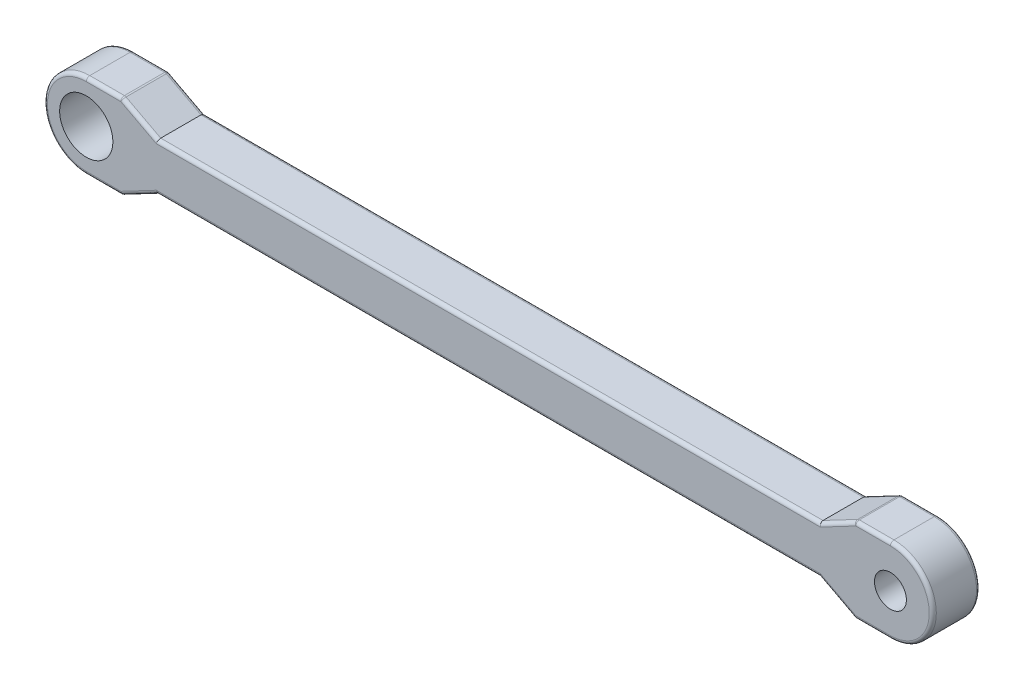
ISO-10303-21;
HEADER;
FILE_DESCRIPTION(('STEP AP214'),'2;1');
FILE_NAME('part.step','',(''),(''),'','','');
FILE_SCHEMA(('AUTOMOTIVE_DESIGN { 1 0 10303 214 1 1 1 1 }'));
ENDSEC;
DATA;
#1=APPLICATION_CONTEXT('core data for automotive mechanical design processes');
#2=APPLICATION_PROTOCOL_DEFINITION('international standard','automotive_design',2000,#1);
#3=PRODUCT_CONTEXT('',#1,'mechanical');
#4=PRODUCT('Part','Part','',(#3));
#5=PRODUCT_RELATED_PRODUCT_CATEGORY('part','',(#4));
#6=PRODUCT_DEFINITION_FORMATION('','',#4);
#7=PRODUCT_DEFINITION_CONTEXT('part definition',#1,'design');
#8=PRODUCT_DEFINITION('design','',#6,#7);
#9=PRODUCT_DEFINITION_SHAPE('','',#8);
#10=(LENGTH_UNIT() NAMED_UNIT(*) SI_UNIT(.MILLI.,.METRE.));
#11=(NAMED_UNIT(*) PLANE_ANGLE_UNIT() SI_UNIT($,.RADIAN.));
#12=(NAMED_UNIT(*) SI_UNIT($,.STERADIAN.) SOLID_ANGLE_UNIT());
#13=UNCERTAINTY_MEASURE_WITH_UNIT(LENGTH_MEASURE(1.E-05),#10,'distance_accuracy_value','');
#14=(GEOMETRIC_REPRESENTATION_CONTEXT(3) GLOBAL_UNCERTAINTY_ASSIGNED_CONTEXT((#13)) GLOBAL_UNIT_ASSIGNED_CONTEXT((#10,
#11,#12)) REPRESENTATION_CONTEXT('',''));
#15=CARTESIAN_POINT('',(0.,0.,0.));
#16=DIRECTION('',(0.,0.,1.));
#17=DIRECTION('',(1.,0.,0.));
#18=AXIS2_PLACEMENT_3D('',#15,#16,#17);
#19=CARTESIAN_POINT('',(-43.18,0.,5.08));
#20=DIRECTION('',(0.,0.,1.));
#21=DIRECTION('',(1.,0.,0.));
#22=AXIS2_PLACEMENT_3D('',#19,#20,#21);
#23=PLANE('',#22);
#24=CARTESIAN_POINT('',(-43.18,0.,5.08));
#25=DIRECTION('',(0.,0.,1.));
#26=DIRECTION('',(1.,0.,0.));
#27=AXIS2_PLACEMENT_3D('',#24,#25,#26);
#28=CIRCLE('',#27,2.8575);
#29=CARTESIAN_POINT('',(-40.3225,0.,5.08));
#30=VERTEX_POINT('',#29);
#31=EDGE_CURVE('E1100',#30,#30,#28,.T.);
#32=ORIENTED_EDGE('',*,*,#31,.F.);
#33=EDGE_LOOP('',(#32));
#34=FACE_BOUND('',#33,.T.);
#35=CARTESIAN_POINT('',(43.18,0.,5.08));
#36=DIRECTION('',(0.,0.,-1.));
#37=DIRECTION('',(-1.,0.,0.));
#38=AXIS2_PLACEMENT_3D('',#35,#36,#37);
#39=CIRCLE('',#38,1.7145);
#40=CARTESIAN_POINT('',(41.4655,0.,5.08));
#41=VERTEX_POINT('',#40);
#42=EDGE_CURVE('E485',#41,#41,#39,.T.);
#43=ORIENTED_EDGE('',*,*,#42,.T.);
#44=EDGE_LOOP('',(#43));
#45=FACE_BOUND('',#44,.T.);
#46=DIRECTION('',(-1.,0.,0.));
#47=VECTOR('',#46,1.);
#48=CARTESIAN_POINT('',(-43.18,4.167,5.08));
#49=LINE('',#48,#47);
#50=CARTESIAN_POINT('',(-39.4642553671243,4.167,5.08));
#51=VERTEX_POINT('',#50);
#52=CARTESIAN_POINT('',(-43.18,4.167,5.08));
#53=VERTEX_POINT('',#52);
#54=EDGE_CURVE('E316',#51,#53,#49,.T.);
#55=ORIENTED_EDGE('',*,*,#54,.T.);
#56=CARTESIAN_POINT('',(-43.18,0.,5.08));
#57=DIRECTION('',(0.,0.,1.));
#58=DIRECTION('',(1.,0.,0.));
#59=AXIS2_PLACEMENT_3D('',#56,#57,#58);
#60=CIRCLE('',#59,4.167);
#61=CARTESIAN_POINT('',(-43.18,-4.167,5.08));
#62=VERTEX_POINT('',#61);
#63=EDGE_CURVE('E318',#53,#62,#60,.T.);
#64=ORIENTED_EDGE('',*,*,#63,.T.);
#65=DIRECTION('',(1.,0.,0.));
#66=VECTOR('',#65,1.);
#67=CARTESIAN_POINT('',(-39.37,-4.167,5.08));
#68=LINE('',#67,#66);
#69=CARTESIAN_POINT('',(-39.4642553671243,-4.167,5.08));
#70=VERTEX_POINT('',#69);
#71=EDGE_CURVE('E297',#62,#70,#68,.T.);
#72=ORIENTED_EDGE('',*,*,#71,.T.);
#73=DIRECTION('',(-0.884656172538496,-0.466243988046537,0.));
#74=VECTOR('',#73,1.);
#75=CARTESIAN_POINT('',(-40.6535143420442,-4.79378005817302,5.08));
#76=LINE('',#75,#74);
#77=CARTESIAN_POINT('',(-35.6542553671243,-2.15899999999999,5.08));
#78=VERTEX_POINT('',#77);
#79=EDGE_CURVE('E299',#70,#78,#76,.F.);
#80=ORIENTED_EDGE('',*,*,#79,.T.);
#81=DIRECTION('',(-1.,0.,0.));
#82=VECTOR('',#81,1.);
#83=CARTESIAN_POINT('',(-43.18,-2.15899999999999,5.08));
#84=LINE('',#83,#82);
#85=CARTESIAN_POINT('',(35.6542553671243,-2.15899999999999,5.08));
#86=VERTEX_POINT('',#85);
#87=EDGE_CURVE('E301',#78,#86,#84,.F.);
#88=ORIENTED_EDGE('',*,*,#87,.T.);
#89=DIRECTION('',(-0.884656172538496,0.466243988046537,0.));
#90=VECTOR('',#89,1.);
#91=CARTESIAN_POINT('',(-26.9332503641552,30.826751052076,5.08));
#92=LINE('',#91,#90);
#93=CARTESIAN_POINT('',(39.4642553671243,-4.16699999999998,5.08));
#94=VERTEX_POINT('',#93);
#95=EDGE_CURVE('E303',#86,#94,#92,.F.);
#96=ORIENTED_EDGE('',*,*,#95,.T.);
#97=DIRECTION('',(1.,0.,0.));
#98=VECTOR('',#97,1.);
#99=CARTESIAN_POINT('',(43.18,-4.16699999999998,5.08));
#100=LINE('',#99,#98);
#101=CARTESIAN_POINT('',(43.18,-4.16699999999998,5.08));
#102=VERTEX_POINT('',#101);
#103=EDGE_CURVE('E305',#94,#102,#100,.T.);
#104=ORIENTED_EDGE('',*,*,#103,.T.);
#105=CARTESIAN_POINT('',(43.18,0.,5.08));
#106=DIRECTION('',(0.,0.,1.));
#107=DIRECTION('',(1.,0.,0.));
#108=AXIS2_PLACEMENT_3D('',#105,#106,#107);
#109=CIRCLE('',#108,4.167);
#110=CARTESIAN_POINT('',(43.18,4.16700000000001,5.08));
#111=VERTEX_POINT('',#110);
#112=EDGE_CURVE('E245',#102,#111,#109,.T.);
#113=ORIENTED_EDGE('',*,*,#112,.T.);
#114=DIRECTION('',(-1.,0.,0.));
#115=VECTOR('',#114,1.);
#116=CARTESIAN_POINT('',(39.37,4.16700000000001,5.08));
#117=LINE('',#116,#115);
#118=CARTESIAN_POINT('',(39.4642553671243,4.16700000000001,5.08));
#119=VERTEX_POINT('',#118);
#120=EDGE_CURVE('E308',#111,#119,#117,.T.);
#121=ORIENTED_EDGE('',*,*,#120,.T.);
#122=DIRECTION('',(0.884656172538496,0.466243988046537,0.));
#123=VECTOR('',#122,1.);
#124=CARTESIAN_POINT('',(-26.9332503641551,-30.826751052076,5.08));
#125=LINE('',#124,#123);
#126=CARTESIAN_POINT('',(35.6542553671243,2.15900000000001,5.08));
#127=VERTEX_POINT('',#126);
#128=EDGE_CURVE('E310',#119,#127,#125,.F.);
#129=ORIENTED_EDGE('',*,*,#128,.T.);
#130=DIRECTION('',(1.,0.,0.));
#131=VECTOR('',#130,1.);
#132=CARTESIAN_POINT('',(-43.18,2.15900000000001,5.08));
#133=LINE('',#132,#131);
#134=CARTESIAN_POINT('',(-35.6542553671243,2.15900000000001,5.08));
#135=VERTEX_POINT('',#134);
#136=EDGE_CURVE('E312',#127,#135,#133,.F.);
#137=ORIENTED_EDGE('',*,*,#136,.T.);
#138=DIRECTION('',(0.884656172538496,-0.466243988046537,0.));
#139=VECTOR('',#138,1.);
#140=CARTESIAN_POINT('',(-40.6535143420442,4.79378005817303,5.08));
#141=LINE('',#140,#139);
#142=EDGE_CURVE('E314',#135,#51,#141,.F.);
#143=ORIENTED_EDGE('',*,*,#142,.T.);
#144=EDGE_LOOP('',(#55,#64,#72,#80,#88,#96,#104,#113,#121,#129,#137,#143));
#145=FACE_BOUND('',#144,.T.);
#146=ADVANCED_FACE('F32',(#34,#45,#145),#23,.T.);
#147=CARTESIAN_POINT('',(-43.18,0.,0.));
#148=DIRECTION('',(0.,0.,1.));
#149=DIRECTION('',(1.,0.,0.));
#150=AXIS2_PLACEMENT_3D('',#147,#148,#149);
#151=PLANE('',#150);
#152=CARTESIAN_POINT('',(-43.18,0.,0.));
#153=DIRECTION('',(0.,0.,1.));
#154=DIRECTION('',(1.,0.,0.));
#155=AXIS2_PLACEMENT_3D('',#152,#153,#154);
#156=CIRCLE('',#155,2.8575);
#157=CARTESIAN_POINT('',(-40.3225,0.,0.));
#158=VERTEX_POINT('',#157);
#159=EDGE_CURVE('E1098',#158,#158,#156,.T.);
#160=ORIENTED_EDGE('',*,*,#159,.T.);
#161=EDGE_LOOP('',(#160));
#162=FACE_BOUND('',#161,.T.);
#163=CARTESIAN_POINT('',(43.18,0.,0.));
#164=DIRECTION('',(0.,0.,-1.));
#165=DIRECTION('',(-1.,0.,0.));
#166=AXIS2_PLACEMENT_3D('',#163,#164,#165);
#167=CIRCLE('',#166,1.7145);
#168=CARTESIAN_POINT('',(41.4655,0.,0.));
#169=VERTEX_POINT('',#168);
#170=EDGE_CURVE('E366',#169,#169,#167,.T.);
#171=ORIENTED_EDGE('',*,*,#170,.F.);
#172=EDGE_LOOP('',(#171));
#173=FACE_BOUND('',#172,.T.);
#174=DIRECTION('',(1.,0.,0.));
#175=VECTOR('',#174,1.);
#176=CARTESIAN_POINT('',(-43.18,-4.167,0.));
#177=LINE('',#176,#175);
#178=CARTESIAN_POINT('',(43.18,-4.16699999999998,0.));
#179=VERTEX_POINT('',#178);
#180=CARTESIAN_POINT('',(39.4642553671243,-4.16699999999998,0.));
#181=VERTEX_POINT('',#180);
#182=EDGE_CURVE('E277',#179,#181,#177,.F.);
#183=ORIENTED_EDGE('',*,*,#182,.T.);
#184=DIRECTION('',(-0.884656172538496,0.466243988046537,0.));
#185=VECTOR('',#184,1.);
#186=CARTESIAN_POINT('',(35.7376389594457,-2.20294599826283,0.));
#187=LINE('',#186,#185);
#188=CARTESIAN_POINT('',(35.6542553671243,-2.15899999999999,0.));
#189=VERTEX_POINT('',#188);
#190=EDGE_CURVE('E229',#181,#189,#187,.T.);
#191=ORIENTED_EDGE('',*,*,#190,.T.);
#192=DIRECTION('',(-1.,0.,0.));
#193=VECTOR('',#192,1.);
#194=CARTESIAN_POINT('',(-35.56,-2.15899999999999,0.));
#195=LINE('',#194,#193);
#196=CARTESIAN_POINT('',(-35.6542553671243,-2.15899999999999,0.));
#197=VERTEX_POINT('',#196);
#198=EDGE_CURVE('E282',#189,#197,#195,.T.);
#199=ORIENTED_EDGE('',*,*,#198,.T.);
#200=DIRECTION('',(-0.884656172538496,-0.466243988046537,0.));
#201=VECTOR('',#200,1.);
#202=CARTESIAN_POINT('',(-39.5476389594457,-4.21094599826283,0.));
#203=LINE('',#202,#201);
#204=CARTESIAN_POINT('',(-39.4642553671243,-4.167,0.));
#205=VERTEX_POINT('',#204);
#206=EDGE_CURVE('E280',#197,#205,#203,.T.);
#207=ORIENTED_EDGE('',*,*,#206,.T.);
#208=DIRECTION('',(1.,0.,0.));
#209=VECTOR('',#208,1.);
#210=CARTESIAN_POINT('',(-43.18,-4.167,0.));
#211=LINE('',#210,#209);
#212=CARTESIAN_POINT('',(-43.18,-4.167,0.));
#213=VERTEX_POINT('',#212);
#214=EDGE_CURVE('E273',#205,#213,#211,.F.);
#215=ORIENTED_EDGE('',*,*,#214,.T.);
#216=CARTESIAN_POINT('',(-43.18,0.,0.));
#217=DIRECTION('',(0.,0.,1.));
#218=DIRECTION('',(1.,0.,0.));
#219=AXIS2_PLACEMENT_3D('',#216,#217,#218);
#220=CIRCLE('',#219,4.167);
#221=CARTESIAN_POINT('',(-43.18,4.167,0.));
#222=VERTEX_POINT('',#221);
#223=EDGE_CURVE('E271',#213,#222,#220,.F.);
#224=ORIENTED_EDGE('',*,*,#223,.T.);
#225=DIRECTION('',(-1.,0.,0.));
#226=VECTOR('',#225,1.);
#227=CARTESIAN_POINT('',(-43.18,4.167,0.));
#228=LINE('',#227,#226);
#229=CARTESIAN_POINT('',(-39.4642553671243,4.167,0.));
#230=VERTEX_POINT('',#229);
#231=EDGE_CURVE('E257',#222,#230,#228,.F.);
#232=ORIENTED_EDGE('',*,*,#231,.T.);
#233=DIRECTION('',(0.884656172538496,-0.466243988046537,0.));
#234=VECTOR('',#233,1.);
#235=CARTESIAN_POINT('',(-35.7376389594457,2.20294599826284,0.));
#236=LINE('',#235,#234);
#237=CARTESIAN_POINT('',(-35.6542553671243,2.15900000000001,0.));
#238=VERTEX_POINT('',#237);
#239=EDGE_CURVE('E263',#230,#238,#236,.T.);
#240=ORIENTED_EDGE('',*,*,#239,.T.);
#241=DIRECTION('',(1.,0.,0.));
#242=VECTOR('',#241,1.);
#243=CARTESIAN_POINT('',(35.56,2.15900000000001,0.));
#244=LINE('',#243,#242);
#245=CARTESIAN_POINT('',(35.6542553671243,2.15900000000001,0.));
#246=VERTEX_POINT('',#245);
#247=EDGE_CURVE('E265',#238,#246,#244,.T.);
#248=ORIENTED_EDGE('',*,*,#247,.T.);
#249=DIRECTION('',(0.884656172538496,0.466243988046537,0.));
#250=VECTOR('',#249,1.);
#251=CARTESIAN_POINT('',(39.5476389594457,4.21094599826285,0.));
#252=LINE('',#251,#250);
#253=CARTESIAN_POINT('',(39.4642553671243,4.16700000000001,0.));
#254=VERTEX_POINT('',#253);
#255=EDGE_CURVE('E267',#246,#254,#252,.T.);
#256=ORIENTED_EDGE('',*,*,#255,.T.);
#257=DIRECTION('',(-1.,0.,0.));
#258=VECTOR('',#257,1.);
#259=CARTESIAN_POINT('',(-43.18,4.167,0.));
#260=LINE('',#259,#258);
#261=CARTESIAN_POINT('',(43.18,4.16700000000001,0.));
#262=VERTEX_POINT('',#261);
#263=EDGE_CURVE('E269',#254,#262,#260,.F.);
#264=ORIENTED_EDGE('',*,*,#263,.T.);
#265=CARTESIAN_POINT('',(43.18,0.,0.));
#266=DIRECTION('',(0.,0.,1.));
#267=DIRECTION('',(1.,0.,0.));
#268=AXIS2_PLACEMENT_3D('',#265,#266,#267);
#269=CIRCLE('',#268,4.167);
#270=EDGE_CURVE('E275',#262,#179,#269,.F.);
#271=ORIENTED_EDGE('',*,*,#270,.T.);
#272=EDGE_LOOP('',(#183,#191,#199,#207,#215,#224,#232,#240,#248,#256,#264,#271));
#273=FACE_BOUND('',#272,.T.);
#274=ADVANCED_FACE('F555',(#162,#173,#273),#151,.F.);
#275=CARTESIAN_POINT('',(-43.18,-4.548,5.08));
#276=DIRECTION('',(0.,1.,0.));
#277=DIRECTION('',(-1.,0.,0.));
#278=AXIS2_PLACEMENT_3D('',#275,#276,#277);
#279=PLANE('',#278);
#280=DIRECTION('',(0.,0.,-1.));
#281=VECTOR('',#280,1.);
#282=CARTESIAN_POINT('',(-43.18,-4.548,5.08));
#283=LINE('',#282,#281);
#284=CARTESIAN_POINT('',(-43.18,-4.548,4.699));
#285=VERTEX_POINT('',#284);
#286=CARTESIAN_POINT('',(-43.18,-4.548,0.381));
#287=VERTEX_POINT('',#286);
#288=EDGE_CURVE('E239',#285,#287,#283,.T.);
#289=ORIENTED_EDGE('',*,*,#288,.T.);
#290=DIRECTION('',(1.,0.,0.));
#291=VECTOR('',#290,1.);
#292=CARTESIAN_POINT('',(-43.18,-4.548,0.381));
#293=LINE('',#292,#291);
#294=CARTESIAN_POINT('',(-39.4642553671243,-4.548,0.381));
#295=VERTEX_POINT('',#294);
#296=EDGE_CURVE('E290',#287,#295,#293,.T.);
#297=ORIENTED_EDGE('',*,*,#296,.T.);
#298=DIRECTION('',(0.,0.,-1.));
#299=VECTOR('',#298,1.);
#300=CARTESIAN_POINT('',(-39.4642553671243,-4.548,5.08));
#301=LINE('',#300,#299);
#302=CARTESIAN_POINT('',(-39.4642553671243,-4.548,4.699));
#303=VERTEX_POINT('',#302);
#304=EDGE_CURVE('E286',#295,#303,#301,.F.);
#305=ORIENTED_EDGE('',*,*,#304,.T.);
#306=DIRECTION('',(1.,0.,0.));
#307=VECTOR('',#306,1.);
#308=CARTESIAN_POINT('',(-43.18,-4.548,4.699));
#309=LINE('',#308,#307);
#310=EDGE_CURVE('E288',#303,#285,#309,.F.);
#311=ORIENTED_EDGE('',*,*,#310,.T.);
#312=EDGE_LOOP('',(#289,#297,#305,#311));
#313=FACE_BOUND('',#312,.T.);
#314=ADVANCED_FACE('F500',(#313),#279,.F.);
#315=DIRECTION('',(0.,0.,-1.));
#316=VECTOR('',#315,1.);
#317=CARTESIAN_POINT('',(39.4642553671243,-4.54799999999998,0.));
#318=LINE('',#317,#316);
#319=CARTESIAN_POINT('',(39.4642553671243,-4.54799999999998,4.699));
#320=VERTEX_POINT('',#319);
#321=CARTESIAN_POINT('',(39.4642553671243,-4.54799999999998,0.381));
#322=VERTEX_POINT('',#321);
#323=EDGE_CURVE('E255',#320,#322,#318,.T.);
#324=ORIENTED_EDGE('',*,*,#323,.T.);
#325=DIRECTION('',(1.,0.,0.));
#326=VECTOR('',#325,1.);
#327=CARTESIAN_POINT('',(-43.18,-4.548,0.381));
#328=LINE('',#327,#326);
#329=CARTESIAN_POINT('',(43.18,-4.54799999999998,0.381));
#330=VERTEX_POINT('',#329);
#331=EDGE_CURVE('E238',#322,#330,#328,.T.);
#332=ORIENTED_EDGE('',*,*,#331,.T.);
#333=DIRECTION('',(0.,0.,-1.));
#334=VECTOR('',#333,1.);
#335=CARTESIAN_POINT('',(43.18,-4.54799999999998,5.08));
#336=LINE('',#335,#334);
#337=CARTESIAN_POINT('',(43.18,-4.54799999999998,4.699));
#338=VERTEX_POINT('',#337);
#339=EDGE_CURVE('E221',#338,#330,#336,.T.);
#340=ORIENTED_EDGE('',*,*,#339,.F.);
#341=DIRECTION('',(1.,0.,0.));
#342=VECTOR('',#341,1.);
#343=CARTESIAN_POINT('',(39.37,-4.54799999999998,4.699));
#344=LINE('',#343,#342);
#345=EDGE_CURVE('E235',#338,#320,#344,.F.);
#346=ORIENTED_EDGE('',*,*,#345,.T.);
#347=EDGE_LOOP('',(#324,#332,#340,#346));
#348=FACE_BOUND('',#347,.T.);
#349=ADVANCED_FACE('F233',(#348),#279,.F.);
#350=CARTESIAN_POINT('',(-43.18,4.548,5.08));
#351=DIRECTION('',(0.,-1.,0.));
#352=DIRECTION('',(1.,0.,0.));
#353=AXIS2_PLACEMENT_3D('',#350,#351,#352);
#354=PLANE('',#353);
#355=DIRECTION('',(0.,0.,-1.));
#356=VECTOR('',#355,1.);
#357=CARTESIAN_POINT('',(-43.18,4.548,5.08));
#358=LINE('',#357,#356);
#359=CARTESIAN_POINT('',(-43.18,4.548,4.699));
#360=VERTEX_POINT('',#359);
#361=CARTESIAN_POINT('',(-43.18,4.548,0.381));
#362=VERTEX_POINT('',#361);
#363=EDGE_CURVE('E493',#360,#362,#358,.T.);
#364=ORIENTED_EDGE('',*,*,#363,.F.);
#365=DIRECTION('',(-1.,0.,0.));
#366=VECTOR('',#365,1.);
#367=CARTESIAN_POINT('',(-39.37,4.548,4.699));
#368=LINE('',#367,#366);
#369=CARTESIAN_POINT('',(-39.4642553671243,4.548,4.699));
#370=VERTEX_POINT('',#369);
#371=EDGE_CURVE('E325',#360,#370,#368,.F.);
#372=ORIENTED_EDGE('',*,*,#371,.T.);
#373=DIRECTION('',(0.,0.,-1.));
#374=VECTOR('',#373,1.);
#375=CARTESIAN_POINT('',(-39.4642553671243,4.548,0.));
#376=LINE('',#375,#374);
#377=CARTESIAN_POINT('',(-39.4642553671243,4.548,0.381));
#378=VERTEX_POINT('',#377);
#379=EDGE_CURVE('E321',#370,#378,#376,.T.);
#380=ORIENTED_EDGE('',*,*,#379,.T.);
#381=DIRECTION('',(-1.,0.,0.));
#382=VECTOR('',#381,1.);
#383=CARTESIAN_POINT('',(-43.18,4.548,0.381));
#384=LINE('',#383,#382);
#385=EDGE_CURVE('E323',#378,#362,#384,.T.);
#386=ORIENTED_EDGE('',*,*,#385,.T.);
#387=EDGE_LOOP('',(#364,#372,#380,#386));
#388=FACE_BOUND('',#387,.T.);
#389=ADVANCED_FACE('F538',(#388),#354,.F.);
#390=DIRECTION('',(0.,0.,-1.));
#391=VECTOR('',#390,1.);
#392=CARTESIAN_POINT('',(39.4642553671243,4.54800000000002,5.08));
#393=LINE('',#392,#391);
#394=CARTESIAN_POINT('',(39.4642553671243,4.54800000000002,0.381));
#395=VERTEX_POINT('',#394);
#396=CARTESIAN_POINT('',(39.4642553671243,4.54800000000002,4.699));
#397=VERTEX_POINT('',#396);
#398=EDGE_CURVE('E344',#395,#397,#393,.F.);
#399=ORIENTED_EDGE('',*,*,#398,.T.);
#400=DIRECTION('',(-1.,0.,0.));
#401=VECTOR('',#400,1.);
#402=CARTESIAN_POINT('',(43.18,4.54800000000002,4.699));
#403=LINE('',#402,#401);
#404=CARTESIAN_POINT('',(43.18,4.54800000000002,4.699));
#405=VERTEX_POINT('',#404);
#406=EDGE_CURVE('E348',#397,#405,#403,.F.);
#407=ORIENTED_EDGE('',*,*,#406,.T.);
#408=DIRECTION('',(0.,0.,-1.));
#409=VECTOR('',#408,1.);
#410=CARTESIAN_POINT('',(43.18,4.54800000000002,5.08));
#411=LINE('',#410,#409);
#412=CARTESIAN_POINT('',(43.18,4.54800000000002,0.381));
#413=VERTEX_POINT('',#412);
#414=EDGE_CURVE('E223',#405,#413,#411,.T.);
#415=ORIENTED_EDGE('',*,*,#414,.T.);
#416=DIRECTION('',(-1.,0.,0.));
#417=VECTOR('',#416,1.);
#418=CARTESIAN_POINT('',(-43.18,4.548,0.381));
#419=LINE('',#418,#417);
#420=EDGE_CURVE('E346',#413,#395,#419,.T.);
#421=ORIENTED_EDGE('',*,*,#420,.T.);
#422=EDGE_LOOP('',(#399,#407,#415,#421));
#423=FACE_BOUND('',#422,.T.);
#424=ADVANCED_FACE('F601',(#423),#354,.F.);
#425=CARTESIAN_POINT('',(-43.18,0.,5.08));
#426=DIRECTION('',(0.,0.,-1.));
#427=DIRECTION('',(-1.,0.,0.));
#428=AXIS2_PLACEMENT_3D('',#425,#426,#427);
#429=CYLINDRICAL_SURFACE('',#428,4.548);
#430=ORIENTED_EDGE('',*,*,#363,.T.);
#431=CARTESIAN_POINT('',(-43.18,0.,0.381));
#432=DIRECTION('',(0.,0.,1.));
#433=DIRECTION('',(1.,0.,0.));
#434=AXIS2_PLACEMENT_3D('',#431,#432,#433);
#435=CIRCLE('',#434,4.548);
#436=EDGE_CURVE('E295',#362,#287,#435,.T.);
#437=ORIENTED_EDGE('',*,*,#436,.T.);
#438=ORIENTED_EDGE('',*,*,#288,.F.);
#439=CARTESIAN_POINT('',(-43.18,0.,4.699));
#440=DIRECTION('',(0.,0.,1.));
#441=DIRECTION('',(1.,0.,0.));
#442=AXIS2_PLACEMENT_3D('',#439,#440,#441);
#443=CIRCLE('',#442,4.548);
#444=EDGE_CURVE('E293',#285,#360,#443,.F.);
#445=ORIENTED_EDGE('',*,*,#444,.T.);
#446=EDGE_LOOP('',(#430,#437,#438,#445));
#447=FACE_BOUND('',#446,.T.);
#448=ADVANCED_FACE('F534',(#447),#429,.T.);
#449=CARTESIAN_POINT('',(43.18,0.,5.08));
#450=DIRECTION('',(0.,0.,-1.));
#451=DIRECTION('',(-1.,0.,0.));
#452=AXIS2_PLACEMENT_3D('',#449,#450,#451);
#453=CYLINDRICAL_SURFACE('',#452,4.548);
#454=ORIENTED_EDGE('',*,*,#339,.T.);
#455=CARTESIAN_POINT('',(43.18,0.,0.381));
#456=DIRECTION('',(0.,0.,1.));
#457=DIRECTION('',(1.,0.,0.));
#458=AXIS2_PLACEMENT_3D('',#455,#456,#457);
#459=CIRCLE('',#458,4.548);
#460=EDGE_CURVE('E228',#330,#413,#459,.T.);
#461=ORIENTED_EDGE('',*,*,#460,.T.);
#462=ORIENTED_EDGE('',*,*,#414,.F.);
#463=CARTESIAN_POINT('',(43.18,0.,4.699));
#464=DIRECTION('',(0.,0.,1.));
#465=DIRECTION('',(1.,0.,0.));
#466=AXIS2_PLACEMENT_3D('',#463,#464,#465);
#467=CIRCLE('',#466,4.548);
#468=EDGE_CURVE('E218',#405,#338,#467,.F.);
#469=ORIENTED_EDGE('',*,*,#468,.T.);
#470=EDGE_LOOP('',(#454,#461,#462,#469));
#471=FACE_BOUND('',#470,.T.);
#472=ADVANCED_FACE('F220',(#471),#453,.T.);
#473=CARTESIAN_POINT('',(-39.37,4.54800000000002,5.08));
#474=DIRECTION('',(0.466243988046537,0.884656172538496,0.));
#475=DIRECTION('',(-0.884656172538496,0.466243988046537,0.));
#476=AXIS2_PLACEMENT_3D('',#473,#474,#475);
#477=PLANE('',#476);
#478=DIRECTION('',(0.,0.,-1.));
#479=VECTOR('',#478,1.);
#480=CARTESIAN_POINT('',(-39.2866164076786,4.50405400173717,5.08));
#481=LINE('',#480,#479);
#482=CARTESIAN_POINT('',(-39.2866164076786,4.50405400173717,0.381));
#483=VERTEX_POINT('',#482);
#484=CARTESIAN_POINT('',(-39.2866164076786,4.50405400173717,4.699));
#485=VERTEX_POINT('',#484);
#486=EDGE_CURVE('E327',#483,#485,#481,.F.);
#487=ORIENTED_EDGE('',*,*,#486,.T.);
#488=DIRECTION('',(0.884656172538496,-0.466243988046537,0.));
#489=VECTOR('',#488,1.);
#490=CARTESIAN_POINT('',(-39.37,4.54800000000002,4.699));
#491=LINE('',#490,#489);
#492=CARTESIAN_POINT('',(-35.56,2.54000000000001,4.699));
#493=VERTEX_POINT('',#492);
#494=EDGE_CURVE('E331',#485,#493,#491,.T.);
#495=ORIENTED_EDGE('',*,*,#494,.T.);
#496=DIRECTION('',(0.,0.,-1.));
#497=VECTOR('',#496,1.);
#498=CARTESIAN_POINT('',(-35.56,2.54000000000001,5.08));
#499=LINE('',#498,#497);
#500=CARTESIAN_POINT('',(-35.56,2.54000000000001,0.381));
#501=VERTEX_POINT('',#500);
#502=EDGE_CURVE('E490',#493,#501,#499,.T.);
#503=ORIENTED_EDGE('',*,*,#502,.T.);
#504=DIRECTION('',(0.884656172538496,-0.466243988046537,0.));
#505=VECTOR('',#504,1.);
#506=CARTESIAN_POINT('',(-39.37,4.54800000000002,0.381));
#507=LINE('',#506,#505);
#508=EDGE_CURVE('E329',#501,#483,#507,.F.);
#509=ORIENTED_EDGE('',*,*,#508,.T.);
#510=EDGE_LOOP('',(#487,#495,#503,#509));
#511=FACE_BOUND('',#510,.T.);
#512=ADVANCED_FACE('F637',(#511),#477,.T.);
#513=CARTESIAN_POINT('',(-35.56,2.54000000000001,5.08));
#514=DIRECTION('',(0.,1.,0.));
#515=DIRECTION('',(0.,0.,1.));
#516=AXIS2_PLACEMENT_3D('',#513,#514,#515);
#517=PLANE('',#516);
#518=ORIENTED_EDGE('',*,*,#502,.F.);
#519=DIRECTION('',(1.,0.,0.));
#520=VECTOR('',#519,1.);
#521=CARTESIAN_POINT('',(-35.56,2.54000000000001,4.699));
#522=LINE('',#521,#520);
#523=CARTESIAN_POINT('',(35.56,2.54000000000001,4.699));
#524=VERTEX_POINT('',#523);
#525=EDGE_CURVE('E336',#493,#524,#522,.T.);
#526=ORIENTED_EDGE('',*,*,#525,.T.);
#527=DIRECTION('',(0.,0.,-1.));
#528=VECTOR('',#527,1.);
#529=CARTESIAN_POINT('',(35.56,2.54000000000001,5.08));
#530=LINE('',#529,#528);
#531=CARTESIAN_POINT('',(35.56,2.54000000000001,0.381));
#532=VERTEX_POINT('',#531);
#533=EDGE_CURVE('E482',#524,#532,#530,.T.);
#534=ORIENTED_EDGE('',*,*,#533,.T.);
#535=DIRECTION('',(1.,0.,0.));
#536=VECTOR('',#535,1.);
#537=CARTESIAN_POINT('',(-35.56,2.54000000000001,0.381));
#538=LINE('',#537,#536);
#539=EDGE_CURVE('E334',#532,#501,#538,.F.);
#540=ORIENTED_EDGE('',*,*,#539,.T.);
#541=EDGE_LOOP('',(#518,#526,#534,#540));
#542=FACE_BOUND('',#541,.T.);
#543=ADVANCED_FACE('F640',(#542),#517,.T.);
#544=CARTESIAN_POINT('',(35.56,2.54000000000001,5.08));
#545=DIRECTION('',(-0.466243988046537,0.884656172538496,0.));
#546=DIRECTION('',(-0.884656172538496,-0.466243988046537,0.));
#547=AXIS2_PLACEMENT_3D('',#544,#545,#546);
#548=PLANE('',#547);
#549=ORIENTED_EDGE('',*,*,#533,.F.);
#550=DIRECTION('',(0.884656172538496,0.466243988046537,0.));
#551=VECTOR('',#550,1.);
#552=CARTESIAN_POINT('',(35.56,2.54000000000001,4.699));
#553=LINE('',#552,#551);
#554=CARTESIAN_POINT('',(39.2866164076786,4.50405400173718,4.699));
#555=VERTEX_POINT('',#554);
#556=EDGE_CURVE('E342',#524,#555,#553,.T.);
#557=ORIENTED_EDGE('',*,*,#556,.T.);
#558=DIRECTION('',(0.,0.,-1.));
#559=VECTOR('',#558,1.);
#560=CARTESIAN_POINT('',(39.2866164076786,4.50405400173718,0.));
#561=LINE('',#560,#559);
#562=CARTESIAN_POINT('',(39.2866164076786,4.50405400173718,0.381));
#563=VERTEX_POINT('',#562);
#564=EDGE_CURVE('E338',#555,#563,#561,.T.);
#565=ORIENTED_EDGE('',*,*,#564,.T.);
#566=DIRECTION('',(0.884656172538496,0.466243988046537,0.));
#567=VECTOR('',#566,1.);
#568=CARTESIAN_POINT('',(35.56,2.54000000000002,0.381));
#569=LINE('',#568,#567);
#570=EDGE_CURVE('E340',#563,#532,#569,.F.);
#571=ORIENTED_EDGE('',*,*,#570,.T.);
#572=EDGE_LOOP('',(#549,#557,#565,#571));
#573=FACE_BOUND('',#572,.T.);
#574=ADVANCED_FACE('F765',(#573),#548,.T.);
#575=CARTESIAN_POINT('',(-39.37,-4.548,5.08));
#576=DIRECTION('',(0.466243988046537,-0.884656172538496,0.));
#577=DIRECTION('',(0.884656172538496,0.466243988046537,0.));
#578=AXIS2_PLACEMENT_3D('',#575,#576,#577);
#579=PLANE('',#578);
#580=DIRECTION('',(0.,0.,-1.));
#581=VECTOR('',#580,1.);
#582=CARTESIAN_POINT('',(-35.56,-2.53999999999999,5.08));
#583=LINE('',#582,#581);
#584=CARTESIAN_POINT('',(-35.56,-2.53999999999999,4.699));
#585=VERTEX_POINT('',#584);
#586=CARTESIAN_POINT('',(-35.56,-2.53999999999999,0.381));
#587=VERTEX_POINT('',#586);
#588=EDGE_CURVE('E471',#585,#587,#583,.T.);
#589=ORIENTED_EDGE('',*,*,#588,.F.);
#590=DIRECTION('',(-0.884656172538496,-0.466243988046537,0.));
#591=VECTOR('',#590,1.);
#592=CARTESIAN_POINT('',(-39.37,-4.548,4.699));
#593=LINE('',#592,#591);
#594=CARTESIAN_POINT('',(-39.2866164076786,-4.50405400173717,4.699));
#595=VERTEX_POINT('',#594);
#596=EDGE_CURVE('E11',#585,#595,#593,.T.);
#597=ORIENTED_EDGE('',*,*,#596,.T.);
#598=DIRECTION('',(0.,0.,-1.));
#599=VECTOR('',#598,1.);
#600=CARTESIAN_POINT('',(-39.2866164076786,-4.50405400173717,0.));
#601=LINE('',#600,#599);
#602=CARTESIAN_POINT('',(-39.2866164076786,-4.50405400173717,0.381));
#603=VERTEX_POINT('',#602);
#604=EDGE_CURVE('E48',#595,#603,#601,.T.);
#605=ORIENTED_EDGE('',*,*,#604,.T.);
#606=DIRECTION('',(-0.884656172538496,-0.466243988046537,0.));
#607=VECTOR('',#606,1.);
#608=CARTESIAN_POINT('',(-35.56,-2.53999999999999,0.381));
#609=LINE('',#608,#607);
#610=EDGE_CURVE('E41',#603,#587,#609,.F.);
#611=ORIENTED_EDGE('',*,*,#610,.T.);
#612=EDGE_LOOP('',(#589,#597,#605,#611));
#613=FACE_BOUND('',#612,.T.);
#614=ADVANCED_FACE('F772',(#613),#579,.T.);
#615=CARTESIAN_POINT('',(35.56,-2.53999999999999,5.08));
#616=DIRECTION('',(-0.466243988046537,-0.884656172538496,0.));
#617=DIRECTION('',(0.884656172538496,-0.466243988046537,0.));
#618=AXIS2_PLACEMENT_3D('',#615,#616,#617);
#619=PLANE('',#618);
#620=DIRECTION('',(0.,0.,-1.));
#621=VECTOR('',#620,1.);
#622=CARTESIAN_POINT('',(39.2866164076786,-4.50405400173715,5.08));
#623=LINE('',#622,#621);
#624=CARTESIAN_POINT('',(39.2866164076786,-4.50405400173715,0.381));
#625=VERTEX_POINT('',#624);
#626=CARTESIAN_POINT('',(39.2866164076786,-4.50405400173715,4.699));
#627=VERTEX_POINT('',#626);
#628=EDGE_CURVE('E350',#625,#627,#623,.F.);
#629=ORIENTED_EDGE('',*,*,#628,.T.);
#630=DIRECTION('',(-0.884656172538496,0.466243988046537,0.));
#631=VECTOR('',#630,1.);
#632=CARTESIAN_POINT('',(35.56,-2.53999999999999,4.699));
#633=LINE('',#632,#631);
#634=CARTESIAN_POINT('',(35.56,-2.53999999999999,4.699));
#635=VERTEX_POINT('',#634);
#636=EDGE_CURVE('E354',#627,#635,#633,.T.);
#637=ORIENTED_EDGE('',*,*,#636,.T.);
#638=DIRECTION('',(0.,0.,-1.));
#639=VECTOR('',#638,1.);
#640=CARTESIAN_POINT('',(35.56,-2.53999999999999,5.08));
#641=LINE('',#640,#639);
#642=CARTESIAN_POINT('',(35.56,-2.53999999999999,0.381));
#643=VERTEX_POINT('',#642);
#644=EDGE_CURVE('E477',#635,#643,#641,.T.);
#645=ORIENTED_EDGE('',*,*,#644,.T.);
#646=DIRECTION('',(-0.884656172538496,0.466243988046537,0.));
#647=VECTOR('',#646,1.);
#648=CARTESIAN_POINT('',(39.37,-4.54800000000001,0.381));
#649=LINE('',#648,#647);
#650=EDGE_CURVE('E352',#643,#625,#649,.F.);
#651=ORIENTED_EDGE('',*,*,#650,.T.);
#652=EDGE_LOOP('',(#629,#637,#645,#651));
#653=FACE_BOUND('',#652,.T.);
#654=ADVANCED_FACE('F571',(#653),#619,.T.);
#655=CARTESIAN_POINT('',(-35.56,-2.53999999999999,5.08));
#656=DIRECTION('',(0.,-1.,0.));
#657=DIRECTION('',(0.,0.,-1.));
#658=AXIS2_PLACEMENT_3D('',#655,#656,#657);
#659=PLANE('',#658);
#660=ORIENTED_EDGE('',*,*,#644,.F.);
#661=DIRECTION('',(-1.,0.,0.));
#662=VECTOR('',#661,1.);
#663=CARTESIAN_POINT('',(-35.56,-2.53999999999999,4.699));
#664=LINE('',#663,#662);
#665=EDGE_CURVE('E359',#635,#585,#664,.T.);
#666=ORIENTED_EDGE('',*,*,#665,.T.);
#667=ORIENTED_EDGE('',*,*,#588,.T.);
#668=DIRECTION('',(-1.,0.,0.));
#669=VECTOR('',#668,1.);
#670=CARTESIAN_POINT('',(35.56,-2.53999999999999,0.381));
#671=LINE('',#670,#669);
#672=EDGE_CURVE('E357',#587,#643,#671,.F.);
#673=ORIENTED_EDGE('',*,*,#672,.T.);
#674=EDGE_LOOP('',(#660,#666,#667,#673));
#675=FACE_BOUND('',#674,.T.);
#676=ADVANCED_FACE('F569',(#675),#659,.T.);
#677=CARTESIAN_POINT('',(-43.18,4.167,4.699));
#678=DIRECTION('',(1.,0.,0.));
#679=DIRECTION('',(0.,1.,0.));
#680=AXIS2_PLACEMENT_3D('',#677,#678,#679);
#681=CYLINDRICAL_SURFACE('',#680,0.381);
#682=CARTESIAN_POINT('',(-39.4642553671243,4.167,4.699));
#683=DIRECTION('',(1.,0.,0.));
#684=DIRECTION('',(0.,0.,-1.));
#685=AXIS2_PLACEMENT_3D('',#682,#683,#684);
#686=CIRCLE('',#685,0.381);
#687=EDGE_CURVE('E464',#370,#51,#686,.T.);
#688=ORIENTED_EDGE('',*,*,#687,.F.);
#689=ORIENTED_EDGE('',*,*,#371,.F.);
#690=CARTESIAN_POINT('',(-43.18,4.167,4.699));
#691=DIRECTION('',(-1.,0.,0.));
#692=DIRECTION('',(0.,0.,1.));
#693=AXIS2_PLACEMENT_3D('',#690,#691,#692);
#694=CIRCLE('',#693,0.381);
#695=EDGE_CURVE('E36',#53,#360,#694,.T.);
#696=ORIENTED_EDGE('',*,*,#695,.F.);
#697=ORIENTED_EDGE('',*,*,#54,.F.);
#698=EDGE_LOOP('',(#688,#689,#696,#697));
#699=FACE_BOUND('',#698,.T.);
#700=ADVANCED_FACE('F34',(#699),#681,.T.);
#701=CARTESIAN_POINT('',(-43.18,0.,4.699));
#702=DIRECTION('',(0.,0.,1.));
#703=DIRECTION('',(1.,0.,0.));
#704=AXIS2_PLACEMENT_3D('',#701,#702,#703);
#705=TOROIDAL_SURFACE('',#704,4.167,0.381);
#706=ORIENTED_EDGE('',*,*,#695,.T.);
#707=ORIENTED_EDGE('',*,*,#444,.F.);
#708=CARTESIAN_POINT('',(-43.18,-4.167,4.699));
#709=DIRECTION('',(1.,0.,0.));
#710=DIRECTION('',(0.,0.,-1.));
#711=AXIS2_PLACEMENT_3D('',#708,#709,#710);
#712=CIRCLE('',#711,0.381);
#713=EDGE_CURVE('E462',#62,#285,#712,.T.);
#714=ORIENTED_EDGE('',*,*,#713,.F.);
#715=ORIENTED_EDGE('',*,*,#63,.F.);
#716=EDGE_LOOP('',(#706,#707,#714,#715));
#717=FACE_BOUND('',#716,.T.);
#718=ADVANCED_FACE('F532',(#717),#705,.T.);
#719=CARTESIAN_POINT('',(-39.4642553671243,4.167,4.699));
#720=DIRECTION('',(0.,0.,1.));
#721=DIRECTION('',(1.,0.,0.));
#722=AXIS2_PLACEMENT_3D('',#719,#720,#721);
#723=SPHERICAL_SURFACE('',#722,0.381);
#724=CARTESIAN_POINT('',(-39.4642553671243,4.167,4.699));
#725=DIRECTION('',(0.,0.,1.));
#726=DIRECTION('',(1.,0.,0.));
#727=AXIS2_PLACEMENT_3D('',#724,#725,#726);
#728=CIRCLE('',#727,0.381);
#729=EDGE_CURVE('E456',#370,#485,#728,.F.);
#730=ORIENTED_EDGE('',*,*,#729,.F.);
#731=ORIENTED_EDGE('',*,*,#687,.T.);
#732=CARTESIAN_POINT('',(-39.4642553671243,4.167,4.699));
#733=DIRECTION('',(-0.884656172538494,0.46624398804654,0.));
#734=DIRECTION('',(-0.46624398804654,-0.884656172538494,0.));
#735=AXIS2_PLACEMENT_3D('',#732,#733,#734);
#736=CIRCLE('',#735,0.381);
#737=EDGE_CURVE('E459',#485,#51,#736,.F.);
#738=ORIENTED_EDGE('',*,*,#737,.F.);
#739=EDGE_LOOP('',(#730,#731,#738));
#740=FACE_BOUND('',#739,.T.);
#741=ADVANCED_FACE('F543',(#740),#723,.T.);
#742=CARTESIAN_POINT('',(-43.18,-4.167,4.699));
#743=DIRECTION('',(-1.,0.,0.));
#744=DIRECTION('',(0.,-1.,0.));
#745=AXIS2_PLACEMENT_3D('',#742,#743,#744);
#746=CYLINDRICAL_SURFACE('',#745,0.381);
#747=ORIENTED_EDGE('',*,*,#713,.T.);
#748=ORIENTED_EDGE('',*,*,#310,.F.);
#749=CARTESIAN_POINT('',(-39.4642553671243,-4.167,4.699));
#750=DIRECTION('',(1.,0.,0.));
#751=DIRECTION('',(0.,0.,-1.));
#752=AXIS2_PLACEMENT_3D('',#749,#750,#751);
#753=CIRCLE('',#752,0.381);
#754=EDGE_CURVE('E450',#70,#303,#753,.T.);
#755=ORIENTED_EDGE('',*,*,#754,.F.);
#756=ORIENTED_EDGE('',*,*,#71,.F.);
#757=EDGE_LOOP('',(#747,#748,#755,#756));
#758=FACE_BOUND('',#757,.T.);
#759=ADVANCED_FACE('F520',(#758),#746,.T.);
#760=CARTESIAN_POINT('',(-39.5476389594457,4.21094599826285,4.699));
#761=DIRECTION('',(0.884656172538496,-0.466243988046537,0.));
#762=DIRECTION('',(0.466243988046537,0.884656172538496,0.));
#763=AXIS2_PLACEMENT_3D('',#760,#761,#762);
#764=CYLINDRICAL_SURFACE('',#763,0.381);
#765=ORIENTED_EDGE('',*,*,#737,.T.);
#766=ORIENTED_EDGE('',*,*,#142,.F.);
#767=CARTESIAN_POINT('',(-35.6542553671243,2.15900000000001,4.699));
#768=DIRECTION('',(0.970735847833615,-0.240149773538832,0.));
#769=DIRECTION('',(-0.240149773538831,-0.970735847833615,0.));
#770=AXIS2_PLACEMENT_3D('',#767,#768,#769);
#771=ELLIPSE('',#770,0.392485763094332,0.381);
#772=EDGE_CURVE('E447',#493,#135,#771,.T.);
#773=ORIENTED_EDGE('',*,*,#772,.F.);
#774=ORIENTED_EDGE('',*,*,#494,.F.);
#775=EDGE_LOOP('',(#765,#766,#773,#774));
#776=FACE_BOUND('',#775,.T.);
#777=ADVANCED_FACE('F634',(#776),#764,.T.);
#778=CARTESIAN_POINT('',(-39.4642553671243,4.167,5.08));
#779=DIRECTION('',(0.,0.,1.));
#780=DIRECTION('',(1.,0.,0.));
#781=AXIS2_PLACEMENT_3D('',#778,#779,#780);
#782=CYLINDRICAL_SURFACE('',#781,0.381);
#783=ORIENTED_EDGE('',*,*,#729,.T.);
#784=ORIENTED_EDGE('',*,*,#486,.F.);
#785=CARTESIAN_POINT('',(-39.4642553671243,4.167,0.381));
#786=DIRECTION('',(0.,0.,-1.));
#787=DIRECTION('',(-1.,0.,0.));
#788=AXIS2_PLACEMENT_3D('',#785,#786,#787);
#789=CIRCLE('',#788,0.381);
#790=EDGE_CURVE('E444',#378,#483,#789,.T.);
#791=ORIENTED_EDGE('',*,*,#790,.F.);
#792=ORIENTED_EDGE('',*,*,#379,.F.);
#793=EDGE_LOOP('',(#783,#784,#791,#792));
#794=FACE_BOUND('',#793,.T.);
#795=ADVANCED_FACE('F548',(#794),#782,.T.);
#796=CARTESIAN_POINT('',(-43.18,4.167,0.381));
#797=DIRECTION('',(-1.,0.,0.));
#798=DIRECTION('',(0.,-1.,0.));
#799=AXIS2_PLACEMENT_3D('',#796,#797,#798);
#800=CYLINDRICAL_SURFACE('',#799,0.381);
#801=CARTESIAN_POINT('',(-39.4642553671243,4.167,0.381));
#802=DIRECTION('',(1.,0.,0.));
#803=DIRECTION('',(0.,1.,0.));
#804=AXIS2_PLACEMENT_3D('',#801,#802,#803);
#805=CIRCLE('',#804,0.381);
#806=EDGE_CURVE('E441',#230,#378,#805,.T.);
#807=ORIENTED_EDGE('',*,*,#806,.F.);
#808=ORIENTED_EDGE('',*,*,#231,.F.);
#809=CARTESIAN_POINT('',(-43.18,4.167,0.381));
#810=DIRECTION('',(-1.,0.,0.));
#811=DIRECTION('',(0.,0.,1.));
#812=AXIS2_PLACEMENT_3D('',#809,#810,#811);
#813=CIRCLE('',#812,0.381);
#814=EDGE_CURVE('E453',#362,#222,#813,.T.);
#815=ORIENTED_EDGE('',*,*,#814,.F.);
#816=ORIENTED_EDGE('',*,*,#385,.F.);
#817=EDGE_LOOP('',(#807,#808,#815,#816));
#818=FACE_BOUND('',#817,.T.);
#819=ADVANCED_FACE('F551',(#818),#800,.T.);
#820=CARTESIAN_POINT('',(-43.18,0.,0.381));
#821=DIRECTION('',(0.,0.,1.));
#822=DIRECTION('',(1.,0.,0.));
#823=AXIS2_PLACEMENT_3D('',#820,#821,#822);
#824=TOROIDAL_SURFACE('',#823,4.167,0.381);
#825=ORIENTED_EDGE('',*,*,#814,.T.);
#826=ORIENTED_EDGE('',*,*,#223,.F.);
#827=CARTESIAN_POINT('',(-43.18,-4.167,0.381));
#828=DIRECTION('',(1.,0.,0.));
#829=DIRECTION('',(0.,0.,-1.));
#830=AXIS2_PLACEMENT_3D('',#827,#828,#829);
#831=CIRCLE('',#830,0.381);
#832=EDGE_CURVE('E438',#287,#213,#831,.T.);
#833=ORIENTED_EDGE('',*,*,#832,.F.);
#834=ORIENTED_EDGE('',*,*,#436,.F.);
#835=EDGE_LOOP('',(#825,#826,#833,#834));
#836=FACE_BOUND('',#835,.T.);
#837=ADVANCED_FACE('F507',(#836),#824,.T.);
#838=CARTESIAN_POINT('',(-39.4642553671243,-4.167,4.699));
#839=DIRECTION('',(0.,0.,1.));
#840=DIRECTION('',(1.,0.,0.));
#841=AXIS2_PLACEMENT_3D('',#838,#839,#840);
#842=SPHERICAL_SURFACE('',#841,0.381);
#843=CARTESIAN_POINT('',(-39.4642553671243,-4.167,4.699));
#844=DIRECTION('',(-0.884656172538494,-0.46624398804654,0.));
#845=DIRECTION('',(0.46624398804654,-0.884656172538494,0.));
#846=AXIS2_PLACEMENT_3D('',#843,#844,#845);
#847=CIRCLE('',#846,0.381);
#848=EDGE_CURVE('E433',#70,#595,#847,.F.);
#849=ORIENTED_EDGE('',*,*,#848,.F.);
#850=ORIENTED_EDGE('',*,*,#754,.T.);
#851=CARTESIAN_POINT('',(-39.4642553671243,-4.167,4.699));
#852=DIRECTION('',(0.,0.,1.));
#853=DIRECTION('',(1.,0.,0.));
#854=AXIS2_PLACEMENT_3D('',#851,#852,#853);
#855=CIRCLE('',#854,0.381);
#856=EDGE_CURVE('E435',#595,#303,#855,.F.);
#857=ORIENTED_EDGE('',*,*,#856,.F.);
#858=EDGE_LOOP('',(#849,#850,#857));
#859=FACE_BOUND('',#858,.T.);
#860=ADVANCED_FACE('F524',(#859),#842,.T.);
#861=CARTESIAN_POINT('',(-35.56,2.15900000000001,4.699));
#862=DIRECTION('',(1.,0.,0.));
#863=DIRECTION('',(0.,0.,-1.));
#864=AXIS2_PLACEMENT_3D('',#861,#862,#863);
#865=CYLINDRICAL_SURFACE('',#864,0.381);
#866=ORIENTED_EDGE('',*,*,#772,.T.);
#867=ORIENTED_EDGE('',*,*,#136,.F.);
#868=CARTESIAN_POINT('',(35.6542553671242,2.15899999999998,4.699));
#869=DIRECTION('',(0.970735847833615,0.240149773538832,0.));
#870=DIRECTION('',(0.240149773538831,-0.970735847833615,0.));
#871=AXIS2_PLACEMENT_3D('',#868,#869,#870);
#872=ELLIPSE('',#871,0.392485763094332,0.381);
#873=EDGE_CURVE('E430',#524,#127,#872,.T.);
#874=ORIENTED_EDGE('',*,*,#873,.F.);
#875=ORIENTED_EDGE('',*,*,#525,.F.);
#876=EDGE_LOOP('',(#866,#867,#874,#875));
#877=FACE_BOUND('',#876,.T.);
#878=ADVANCED_FACE('F631',(#877),#865,.T.);
#879=CARTESIAN_POINT('',(-39.4642553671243,4.167,0.381));
#880=DIRECTION('',(0.,0.,1.));
#881=DIRECTION('',(1.,0.,0.));
#882=AXIS2_PLACEMENT_3D('',#879,#880,#881);
#883=SPHERICAL_SURFACE('',#882,0.381);
#884=ORIENTED_EDGE('',*,*,#806,.T.);
#885=ORIENTED_EDGE('',*,*,#790,.T.);
#886=CARTESIAN_POINT('',(-39.4642553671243,4.167,0.381));
#887=DIRECTION('',(-0.884656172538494,0.46624398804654,0.));
#888=DIRECTION('',(-0.46624398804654,-0.884656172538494,0.));
#889=AXIS2_PLACEMENT_3D('',#886,#887,#888);
#890=CIRCLE('',#889,0.381);
#891=EDGE_CURVE('E427',#230,#483,#890,.F.);
#892=ORIENTED_EDGE('',*,*,#891,.F.);
#893=EDGE_LOOP('',(#884,#885,#892));
#894=FACE_BOUND('',#893,.T.);
#895=ADVANCED_FACE('F863',(#894),#883,.T.);
#896=CARTESIAN_POINT('',(-43.18,-4.167,0.381));
#897=DIRECTION('',(1.,0.,0.));
#898=DIRECTION('',(0.,1.,0.));
#899=AXIS2_PLACEMENT_3D('',#896,#897,#898);
#900=CYLINDRICAL_SURFACE('',#899,0.381);
#901=ORIENTED_EDGE('',*,*,#832,.T.);
#902=ORIENTED_EDGE('',*,*,#214,.F.);
#903=CARTESIAN_POINT('',(-39.4642553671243,-4.167,0.381));
#904=DIRECTION('',(1.,0.,0.));
#905=DIRECTION('',(0.,0.,-1.));
#906=AXIS2_PLACEMENT_3D('',#903,#904,#905);
#907=CIRCLE('',#906,0.381);
#908=EDGE_CURVE('E424',#295,#205,#907,.T.);
#909=ORIENTED_EDGE('',*,*,#908,.F.);
#910=ORIENTED_EDGE('',*,*,#296,.F.);
#911=EDGE_LOOP('',(#901,#902,#909,#910));
#912=FACE_BOUND('',#911,.T.);
#913=ADVANCED_FACE('F511',(#912),#900,.T.);
#914=CARTESIAN_POINT('',(-39.4642553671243,-4.167,5.08));
#915=DIRECTION('',(0.,0.,1.));
#916=DIRECTION('',(1.,0.,0.));
#917=AXIS2_PLACEMENT_3D('',#914,#915,#916);
#918=CYLINDRICAL_SURFACE('',#917,0.381);
#919=ORIENTED_EDGE('',*,*,#856,.T.);
#920=ORIENTED_EDGE('',*,*,#304,.F.);
#921=CARTESIAN_POINT('',(-39.4642553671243,-4.167,0.381));
#922=DIRECTION('',(0.,0.,-1.));
#923=DIRECTION('',(-1.,0.,0.));
#924=AXIS2_PLACEMENT_3D('',#921,#922,#923);
#925=CIRCLE('',#924,0.381);
#926=EDGE_CURVE('E422',#603,#295,#925,.T.);
#927=ORIENTED_EDGE('',*,*,#926,.F.);
#928=ORIENTED_EDGE('',*,*,#604,.F.);
#929=EDGE_LOOP('',(#919,#920,#927,#928));
#930=FACE_BOUND('',#929,.T.);
#931=ADVANCED_FACE('F516',(#930),#918,.T.);
#932=CARTESIAN_POINT('',(-39.5476389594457,-4.21094599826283,4.699));
#933=DIRECTION('',(-0.884656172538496,-0.466243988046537,0.));
#934=DIRECTION('',(0.466243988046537,-0.884656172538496,0.));
#935=AXIS2_PLACEMENT_3D('',#932,#933,#934);
#936=CYLINDRICAL_SURFACE('',#935,0.381);
#937=ORIENTED_EDGE('',*,*,#848,.T.);
#938=ORIENTED_EDGE('',*,*,#596,.F.);
#939=CARTESIAN_POINT('',(-35.6542553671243,-2.15899999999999,4.699));
#940=DIRECTION('',(-0.970735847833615,-0.240149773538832,0.));
#941=DIRECTION('',(-0.240149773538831,0.970735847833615,0.));
#942=AXIS2_PLACEMENT_3D('',#939,#940,#941);
#943=ELLIPSE('',#942,0.392485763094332,0.381);
#944=EDGE_CURVE('E419',#78,#585,#943,.F.);
#945=ORIENTED_EDGE('',*,*,#944,.F.);
#946=ORIENTED_EDGE('',*,*,#79,.F.);
#947=EDGE_LOOP('',(#937,#938,#945,#946));
#948=FACE_BOUND('',#947,.T.);
#949=ADVANCED_FACE('F528',(#948),#936,.T.);
#950=CARTESIAN_POINT('',(-43.18,4.167,4.699));
#951=DIRECTION('',(1.,0.,0.));
#952=DIRECTION('',(0.,1.,0.));
#953=AXIS2_PLACEMENT_3D('',#950,#951,#952);
#954=CYLINDRICAL_SURFACE('',#953,0.381);
#955=CARTESIAN_POINT('',(39.4642553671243,4.16700000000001,4.699));
#956=DIRECTION('',(-1.,0.,0.));
#957=DIRECTION('',(0.,0.,1.));
#958=AXIS2_PLACEMENT_3D('',#955,#956,#957);
#959=CIRCLE('',#958,0.381);
#960=EDGE_CURVE('E414',#119,#397,#959,.T.);
#961=ORIENTED_EDGE('',*,*,#960,.F.);
#962=ORIENTED_EDGE('',*,*,#120,.F.);
#963=CARTESIAN_POINT('',(43.18,4.16700000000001,4.699));
#964=DIRECTION('',(1.,0.,0.));
#965=DIRECTION('',(0.,0.,-1.));
#966=AXIS2_PLACEMENT_3D('',#963,#964,#965);
#967=CIRCLE('',#966,0.381);
#968=EDGE_CURVE('E417',#405,#111,#967,.T.);
#969=ORIENTED_EDGE('',*,*,#968,.F.);
#970=ORIENTED_EDGE('',*,*,#406,.F.);
#971=EDGE_LOOP('',(#961,#962,#969,#970));
#972=FACE_BOUND('',#971,.T.);
#973=ADVANCED_FACE('F618',(#972),#954,.T.);
#974=CARTESIAN_POINT('',(35.7376389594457,2.20294599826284,4.699));
#975=DIRECTION('',(0.884656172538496,0.466243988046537,0.));
#976=DIRECTION('',(-0.466243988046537,0.884656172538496,0.));
#977=AXIS2_PLACEMENT_3D('',#974,#975,#976);
#978=CYLINDRICAL_SURFACE('',#977,0.381);
#979=ORIENTED_EDGE('',*,*,#873,.T.);
#980=ORIENTED_EDGE('',*,*,#128,.F.);
#981=CARTESIAN_POINT('',(39.4642553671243,4.16700000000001,4.699));
#982=DIRECTION('',(0.884656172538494,0.46624398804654,0.));
#983=DIRECTION('',(-0.46624398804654,0.884656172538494,0.));
#984=AXIS2_PLACEMENT_3D('',#981,#982,#983);
#985=CIRCLE('',#984,0.381);
#986=EDGE_CURVE('E411',#555,#119,#985,.T.);
#987=ORIENTED_EDGE('',*,*,#986,.F.);
#988=ORIENTED_EDGE('',*,*,#556,.F.);
#989=EDGE_LOOP('',(#979,#980,#987,#988));
#990=FACE_BOUND('',#989,.T.);
#991=ADVANCED_FACE('F626',(#990),#978,.T.);
#992=CARTESIAN_POINT('',(-40.6535143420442,4.79378005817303,0.381));
#993=DIRECTION('',(-0.884656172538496,0.466243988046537,0.));
#994=DIRECTION('',(-0.466243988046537,-0.884656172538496,0.));
#995=AXIS2_PLACEMENT_3D('',#992,#993,#994);
#996=CYLINDRICAL_SURFACE('',#995,0.381);
#997=ORIENTED_EDGE('',*,*,#891,.T.);
#998=ORIENTED_EDGE('',*,*,#508,.F.);
#999=CARTESIAN_POINT('',(-35.6542553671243,2.15900000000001,0.381));
#1000=DIRECTION('',(-0.970735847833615,0.240149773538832,0.));
#1001=DIRECTION('',(-0.240149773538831,-0.970735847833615,0.));
#1002=AXIS2_PLACEMENT_3D('',#999,#1000,#1001);
#1003=ELLIPSE('',#1002,0.392485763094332,0.381);
#1004=EDGE_CURVE('E408',#238,#501,#1003,.F.);
#1005=ORIENTED_EDGE('',*,*,#1004,.F.);
#1006=ORIENTED_EDGE('',*,*,#239,.F.);
#1007=EDGE_LOOP('',(#997,#998,#1005,#1006));
#1008=FACE_BOUND('',#1007,.T.);
#1009=ADVANCED_FACE('F907',(#1008),#996,.T.);
#1010=CARTESIAN_POINT('',(-39.4642553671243,-4.167,0.381));
#1011=DIRECTION('',(0.,0.,1.));
#1012=DIRECTION('',(1.,0.,0.));
#1013=AXIS2_PLACEMENT_3D('',#1010,#1011,#1012);
#1014=SPHERICAL_SURFACE('',#1013,0.381);
#1015=ORIENTED_EDGE('',*,*,#926,.T.);
#1016=ORIENTED_EDGE('',*,*,#908,.T.);
#1017=CARTESIAN_POINT('',(-39.4642553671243,-4.167,0.381));
#1018=DIRECTION('',(-0.884656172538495,-0.466243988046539,0.));
#1019=DIRECTION('',(0.466243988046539,-0.884656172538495,0.));
#1020=AXIS2_PLACEMENT_3D('',#1017,#1018,#1019);
#1021=CIRCLE('',#1020,0.381);
#1022=EDGE_CURVE('E405',#603,#205,#1021,.F.);
#1023=ORIENTED_EDGE('',*,*,#1022,.F.);
#1024=EDGE_LOOP('',(#1015,#1016,#1023));
#1025=FACE_BOUND('',#1024,.T.);
#1026=ADVANCED_FACE('F915',(#1025),#1014,.T.);
#1027=CARTESIAN_POINT('',(-35.56,-2.15899999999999,4.699));
#1028=DIRECTION('',(-1.,0.,0.));
#1029=DIRECTION('',(0.,0.,1.));
#1030=AXIS2_PLACEMENT_3D('',#1027,#1028,#1029);
#1031=CYLINDRICAL_SURFACE('',#1030,0.381);
#1032=ORIENTED_EDGE('',*,*,#944,.T.);
#1033=ORIENTED_EDGE('',*,*,#665,.F.);
#1034=CARTESIAN_POINT('',(35.6542553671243,-2.15899999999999,4.699));
#1035=DIRECTION('',(-0.970735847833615,0.240149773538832,0.));
#1036=DIRECTION('',(0.240149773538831,0.970735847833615,0.));
#1037=AXIS2_PLACEMENT_3D('',#1034,#1035,#1036);
#1038=ELLIPSE('',#1037,0.392485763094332,0.381);
#1039=EDGE_CURVE('E248',#86,#635,#1038,.F.);
#1040=ORIENTED_EDGE('',*,*,#1039,.F.);
#1041=ORIENTED_EDGE('',*,*,#87,.F.);
#1042=EDGE_LOOP('',(#1032,#1033,#1040,#1041));
#1043=FACE_BOUND('',#1042,.T.);
#1044=ADVANCED_FACE('F924',(#1043),#1031,.T.);
#1045=CARTESIAN_POINT('',(43.18,0.,4.699));
#1046=DIRECTION('',(0.,0.,1.));
#1047=DIRECTION('',(1.,0.,0.));
#1048=AXIS2_PLACEMENT_3D('',#1045,#1046,#1047);
#1049=TOROIDAL_SURFACE('',#1048,4.167,0.381);
#1050=ORIENTED_EDGE('',*,*,#968,.T.);
#1051=ORIENTED_EDGE('',*,*,#112,.F.);
#1052=CARTESIAN_POINT('',(43.18,-4.16699999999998,4.699));
#1053=DIRECTION('',(-1.,0.,0.));
#1054=DIRECTION('',(0.,0.,1.));
#1055=AXIS2_PLACEMENT_3D('',#1052,#1053,#1054);
#1056=CIRCLE('',#1055,0.381);
#1057=EDGE_CURVE('E243',#338,#102,#1056,.T.);
#1058=ORIENTED_EDGE('',*,*,#1057,.F.);
#1059=ORIENTED_EDGE('',*,*,#468,.F.);
#1060=EDGE_LOOP('',(#1050,#1051,#1058,#1059));
#1061=FACE_BOUND('',#1060,.T.);
#1062=ADVANCED_FACE('F244',(#1061),#1049,.T.);
#1063=CARTESIAN_POINT('',(39.4642553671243,4.16700000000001,4.699));
#1064=DIRECTION('',(0.,0.,1.));
#1065=DIRECTION('',(1.,0.,0.));
#1066=AXIS2_PLACEMENT_3D('',#1063,#1064,#1065);
#1067=SPHERICAL_SURFACE('',#1066,0.381);
#1068=ORIENTED_EDGE('',*,*,#986,.T.);
#1069=ORIENTED_EDGE('',*,*,#960,.T.);
#1070=CARTESIAN_POINT('',(39.4642553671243,4.16700000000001,4.699));
#1071=DIRECTION('',(0.,0.,1.));
#1072=DIRECTION('',(1.,0.,0.));
#1073=AXIS2_PLACEMENT_3D('',#1070,#1071,#1072);
#1074=CIRCLE('',#1073,0.381);
#1075=EDGE_CURVE('E249',#555,#397,#1074,.F.);
#1076=ORIENTED_EDGE('',*,*,#1075,.F.);
#1077=EDGE_LOOP('',(#1068,#1069,#1076));
#1078=FACE_BOUND('',#1077,.T.);
#1079=ADVANCED_FACE('F621',(#1078),#1067,.T.);
#1080=CARTESIAN_POINT('',(-43.18,2.15900000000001,0.381));
#1081=DIRECTION('',(-1.,0.,0.));
#1082=DIRECTION('',(0.,0.,1.));
#1083=AXIS2_PLACEMENT_3D('',#1080,#1081,#1082);
#1084=CYLINDRICAL_SURFACE('',#1083,0.381);
#1085=ORIENTED_EDGE('',*,*,#1004,.T.);
#1086=ORIENTED_EDGE('',*,*,#539,.F.);
#1087=CARTESIAN_POINT('',(35.6542553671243,2.15900000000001,0.381));
#1088=DIRECTION('',(-0.970735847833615,-0.240149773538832,0.));
#1089=DIRECTION('',(0.240149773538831,-0.970735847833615,0.));
#1090=AXIS2_PLACEMENT_3D('',#1087,#1088,#1089);
#1091=ELLIPSE('',#1090,0.392485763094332,0.381);
#1092=EDGE_CURVE('E399',#246,#532,#1091,.F.);
#1093=ORIENTED_EDGE('',*,*,#1092,.F.);
#1094=ORIENTED_EDGE('',*,*,#247,.F.);
#1095=EDGE_LOOP('',(#1085,#1086,#1093,#1094));
#1096=FACE_BOUND('',#1095,.T.);
#1097=ADVANCED_FACE('F645',(#1096),#1084,.T.);
#1098=CARTESIAN_POINT('',(-40.6535143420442,-4.79378005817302,0.381));
#1099=DIRECTION('',(0.884656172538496,0.466243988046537,0.));
#1100=DIRECTION('',(-0.466243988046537,0.884656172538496,0.));
#1101=AXIS2_PLACEMENT_3D('',#1098,#1099,#1100);
#1102=CYLINDRICAL_SURFACE('',#1101,0.381);
#1103=ORIENTED_EDGE('',*,*,#1022,.T.);
#1104=ORIENTED_EDGE('',*,*,#206,.F.);
#1105=CARTESIAN_POINT('',(-35.6542553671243,-2.15899999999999,0.381));
#1106=DIRECTION('',(0.970735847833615,0.240149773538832,0.));
#1107=DIRECTION('',(0.240149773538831,-0.970735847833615,0.));
#1108=AXIS2_PLACEMENT_3D('',#1105,#1106,#1107);
#1109=ELLIPSE('',#1108,0.392485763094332,0.381);
#1110=EDGE_CURVE('E396',#587,#197,#1109,.T.);
#1111=ORIENTED_EDGE('',*,*,#1110,.F.);
#1112=ORIENTED_EDGE('',*,*,#610,.F.);
#1113=EDGE_LOOP('',(#1103,#1104,#1111,#1112));
#1114=FACE_BOUND('',#1113,.T.);
#1115=ADVANCED_FACE('F561',(#1114),#1102,.T.);
#1116=CARTESIAN_POINT('',(35.7376389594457,-2.20294599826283,4.699));
#1117=DIRECTION('',(-0.884656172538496,0.466243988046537,0.));
#1118=DIRECTION('',(-0.466243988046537,-0.884656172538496,0.));
#1119=AXIS2_PLACEMENT_3D('',#1116,#1117,#1118);
#1120=CYLINDRICAL_SURFACE('',#1119,0.381);
#1121=ORIENTED_EDGE('',*,*,#1039,.T.);
#1122=ORIENTED_EDGE('',*,*,#636,.F.);
#1123=CARTESIAN_POINT('',(39.4642553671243,-4.16699999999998,4.699));
#1124=DIRECTION('',(0.884656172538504,-0.466243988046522,0.));
#1125=DIRECTION('',(0.466243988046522,0.884656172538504,0.));
#1126=AXIS2_PLACEMENT_3D('',#1123,#1124,#1125);
#1127=CIRCLE('',#1126,0.381);
#1128=EDGE_CURVE('E393',#94,#627,#1127,.T.);
#1129=ORIENTED_EDGE('',*,*,#1128,.F.);
#1130=ORIENTED_EDGE('',*,*,#95,.F.);
#1131=EDGE_LOOP('',(#1121,#1122,#1129,#1130));
#1132=FACE_BOUND('',#1131,.T.);
#1133=ADVANCED_FACE('F576',(#1132),#1120,.T.);
#1134=CARTESIAN_POINT('',(-43.18,-4.167,4.699));
#1135=DIRECTION('',(-1.,0.,0.));
#1136=DIRECTION('',(0.,-1.,0.));
#1137=AXIS2_PLACEMENT_3D('',#1134,#1135,#1136);
#1138=CYLINDRICAL_SURFACE('',#1137,0.381);
#1139=ORIENTED_EDGE('',*,*,#1057,.T.);
#1140=ORIENTED_EDGE('',*,*,#103,.F.);
#1141=CARTESIAN_POINT('',(39.4642553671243,-4.16699999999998,4.699));
#1142=DIRECTION('',(-1.,0.,0.));
#1143=DIRECTION('',(0.,0.,1.));
#1144=AXIS2_PLACEMENT_3D('',#1141,#1142,#1143);
#1145=CIRCLE('',#1144,0.381);
#1146=EDGE_CURVE('E253',#320,#94,#1145,.T.);
#1147=ORIENTED_EDGE('',*,*,#1146,.F.);
#1148=ORIENTED_EDGE('',*,*,#345,.F.);
#1149=EDGE_LOOP('',(#1139,#1140,#1147,#1148));
#1150=FACE_BOUND('',#1149,.T.);
#1151=ADVANCED_FACE('F251',(#1150),#1138,.T.);
#1152=CARTESIAN_POINT('',(39.4642553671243,4.16700000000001,5.08));
#1153=DIRECTION('',(0.,0.,1.));
#1154=DIRECTION('',(1.,0.,0.));
#1155=AXIS2_PLACEMENT_3D('',#1152,#1153,#1154);
#1156=CYLINDRICAL_SURFACE('',#1155,0.381);
#1157=ORIENTED_EDGE('',*,*,#1075,.T.);
#1158=ORIENTED_EDGE('',*,*,#398,.F.);
#1159=CARTESIAN_POINT('',(39.4642553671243,4.16700000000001,0.381));
#1160=DIRECTION('',(0.,0.,-1.));
#1161=DIRECTION('',(-1.,0.,0.));
#1162=AXIS2_PLACEMENT_3D('',#1159,#1160,#1161);
#1163=CIRCLE('',#1162,0.381);
#1164=EDGE_CURVE('E389',#563,#395,#1163,.T.);
#1165=ORIENTED_EDGE('',*,*,#1164,.F.);
#1166=ORIENTED_EDGE('',*,*,#564,.F.);
#1167=EDGE_LOOP('',(#1157,#1158,#1165,#1166));
#1168=FACE_BOUND('',#1167,.T.);
#1169=ADVANCED_FACE('F614',(#1168),#1156,.T.);
#1170=CARTESIAN_POINT('',(-26.9332503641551,-30.826751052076,0.381));
#1171=DIRECTION('',(-0.884656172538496,-0.466243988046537,0.));
#1172=DIRECTION('',(0.466243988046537,-0.884656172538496,0.));
#1173=AXIS2_PLACEMENT_3D('',#1170,#1171,#1172);
#1174=CYLINDRICAL_SURFACE('',#1173,0.381);
#1175=ORIENTED_EDGE('',*,*,#1092,.T.);
#1176=ORIENTED_EDGE('',*,*,#570,.F.);
#1177=CARTESIAN_POINT('',(39.4642553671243,4.16700000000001,0.381));
#1178=DIRECTION('',(0.88465617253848,0.466243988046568,0.));
#1179=DIRECTION('',(-0.466243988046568,0.88465617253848,0.));
#1180=AXIS2_PLACEMENT_3D('',#1177,#1178,#1179);
#1181=CIRCLE('',#1180,0.381);
#1182=EDGE_CURVE('E386',#254,#563,#1181,.T.);
#1183=ORIENTED_EDGE('',*,*,#1182,.F.);
#1184=ORIENTED_EDGE('',*,*,#255,.F.);
#1185=EDGE_LOOP('',(#1175,#1176,#1183,#1184));
#1186=FACE_BOUND('',#1185,.T.);
#1187=ADVANCED_FACE('F650',(#1186),#1174,.T.);
#1188=CARTESIAN_POINT('',(-43.18,-2.15899999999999,0.381));
#1189=DIRECTION('',(1.,0.,0.));
#1190=DIRECTION('',(0.,0.,-1.));
#1191=AXIS2_PLACEMENT_3D('',#1188,#1189,#1190);
#1192=CYLINDRICAL_SURFACE('',#1191,0.381);
#1193=ORIENTED_EDGE('',*,*,#1110,.T.);
#1194=ORIENTED_EDGE('',*,*,#198,.F.);
#1195=CARTESIAN_POINT('',(35.6542553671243,-2.15899999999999,0.381));
#1196=DIRECTION('',(0.970735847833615,-0.240149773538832,0.));
#1197=DIRECTION('',(-0.240149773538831,-0.970735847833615,0.));
#1198=AXIS2_PLACEMENT_3D('',#1195,#1196,#1197);
#1199=ELLIPSE('',#1198,0.392485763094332,0.381);
#1200=EDGE_CURVE('E383',#643,#189,#1199,.T.);
#1201=ORIENTED_EDGE('',*,*,#1200,.F.);
#1202=ORIENTED_EDGE('',*,*,#672,.F.);
#1203=EDGE_LOOP('',(#1193,#1194,#1201,#1202));
#1204=FACE_BOUND('',#1203,.T.);
#1205=ADVANCED_FACE('F565',(#1204),#1192,.T.);
#1206=CARTESIAN_POINT('',(39.4642553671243,-4.16699999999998,4.699));
#1207=DIRECTION('',(0.,0.,1.));
#1208=DIRECTION('',(1.,0.,0.));
#1209=AXIS2_PLACEMENT_3D('',#1206,#1207,#1208);
#1210=SPHERICAL_SURFACE('',#1209,0.381);
#1211=ORIENTED_EDGE('',*,*,#1146,.T.);
#1212=ORIENTED_EDGE('',*,*,#1128,.T.);
#1213=CARTESIAN_POINT('',(39.4642553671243,-4.16699999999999,4.699));
#1214=DIRECTION('',(0.,0.,1.));
#1215=DIRECTION('',(1.,0.,0.));
#1216=AXIS2_PLACEMENT_3D('',#1213,#1214,#1215);
#1217=CIRCLE('',#1216,0.381);
#1218=EDGE_CURVE('E380',#320,#627,#1217,.F.);
#1219=ORIENTED_EDGE('',*,*,#1218,.F.);
#1220=EDGE_LOOP('',(#1211,#1212,#1219));
#1221=FACE_BOUND('',#1220,.T.);
#1222=ADVANCED_FACE('F580',(#1221),#1210,.T.);
#1223=CARTESIAN_POINT('',(39.4642553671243,4.16700000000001,0.381));
#1224=DIRECTION('',(0.,0.,1.));
#1225=DIRECTION('',(1.,0.,0.));
#1226=AXIS2_PLACEMENT_3D('',#1223,#1224,#1225);
#1227=SPHERICAL_SURFACE('',#1226,0.381);
#1228=ORIENTED_EDGE('',*,*,#1182,.T.);
#1229=ORIENTED_EDGE('',*,*,#1164,.T.);
#1230=CARTESIAN_POINT('',(39.4642553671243,4.16700000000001,0.381));
#1231=DIRECTION('',(-1.,0.,0.));
#1232=DIRECTION('',(0.,0.,1.));
#1233=AXIS2_PLACEMENT_3D('',#1230,#1231,#1232);
#1234=CIRCLE('',#1233,0.381);
#1235=EDGE_CURVE('E377',#254,#395,#1234,.F.);
#1236=ORIENTED_EDGE('',*,*,#1235,.F.);
#1237=EDGE_LOOP('',(#1228,#1229,#1236));
#1238=FACE_BOUND('',#1237,.T.);
#1239=ADVANCED_FACE('F609',(#1238),#1227,.T.);
#1240=CARTESIAN_POINT('',(-26.9332503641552,30.826751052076,0.381));
#1241=DIRECTION('',(0.884656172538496,-0.466243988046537,0.));
#1242=DIRECTION('',(0.466243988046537,0.884656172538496,0.));
#1243=AXIS2_PLACEMENT_3D('',#1240,#1241,#1242);
#1244=CYLINDRICAL_SURFACE('',#1243,0.381);
#1245=ORIENTED_EDGE('',*,*,#1200,.T.);
#1246=ORIENTED_EDGE('',*,*,#190,.F.);
#1247=CARTESIAN_POINT('',(39.4642553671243,-4.16699999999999,0.381));
#1248=DIRECTION('',(0.884656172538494,-0.46624398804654,0.));
#1249=DIRECTION('',(0.46624398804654,0.884656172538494,0.));
#1250=AXIS2_PLACEMENT_3D('',#1247,#1248,#1249);
#1251=CIRCLE('',#1250,0.381);
#1252=EDGE_CURVE('E374',#625,#181,#1251,.T.);
#1253=ORIENTED_EDGE('',*,*,#1252,.F.);
#1254=ORIENTED_EDGE('',*,*,#650,.F.);
#1255=EDGE_LOOP('',(#1245,#1246,#1253,#1254));
#1256=FACE_BOUND('',#1255,.T.);
#1257=ADVANCED_FACE('F652',(#1256),#1244,.T.);
#1258=CARTESIAN_POINT('',(39.4642553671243,-4.16699999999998,5.08));
#1259=DIRECTION('',(0.,0.,1.));
#1260=DIRECTION('',(1.,0.,0.));
#1261=AXIS2_PLACEMENT_3D('',#1258,#1259,#1260);
#1262=CYLINDRICAL_SURFACE('',#1261,0.381);
#1263=ORIENTED_EDGE('',*,*,#1218,.T.);
#1264=ORIENTED_EDGE('',*,*,#628,.F.);
#1265=CARTESIAN_POINT('',(39.4642553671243,-4.16699999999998,0.381));
#1266=DIRECTION('',(0.,0.,-1.));
#1267=DIRECTION('',(-1.,0.,0.));
#1268=AXIS2_PLACEMENT_3D('',#1265,#1266,#1267);
#1269=CIRCLE('',#1268,0.381);
#1270=EDGE_CURVE('E371',#322,#625,#1269,.T.);
#1271=ORIENTED_EDGE('',*,*,#1270,.F.);
#1272=ORIENTED_EDGE('',*,*,#323,.F.);
#1273=EDGE_LOOP('',(#1263,#1264,#1271,#1272));
#1274=FACE_BOUND('',#1273,.T.);
#1275=ADVANCED_FACE('F583',(#1274),#1262,.T.);
#1276=CARTESIAN_POINT('',(-43.18,4.167,0.381));
#1277=DIRECTION('',(-1.,0.,0.));
#1278=DIRECTION('',(0.,-1.,0.));
#1279=AXIS2_PLACEMENT_3D('',#1276,#1277,#1278);
#1280=CYLINDRICAL_SURFACE('',#1279,0.381);
#1281=ORIENTED_EDGE('',*,*,#1235,.T.);
#1282=ORIENTED_EDGE('',*,*,#420,.F.);
#1283=CARTESIAN_POINT('',(43.18,4.16700000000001,0.381));
#1284=DIRECTION('',(1.,0.,0.));
#1285=DIRECTION('',(0.,0.,-1.));
#1286=AXIS2_PLACEMENT_3D('',#1283,#1284,#1285);
#1287=CIRCLE('',#1286,0.381);
#1288=EDGE_CURVE('E368',#262,#413,#1287,.T.);
#1289=ORIENTED_EDGE('',*,*,#1288,.F.);
#1290=ORIENTED_EDGE('',*,*,#263,.F.);
#1291=EDGE_LOOP('',(#1281,#1282,#1289,#1290));
#1292=FACE_BOUND('',#1291,.T.);
#1293=ADVANCED_FACE('F605',(#1292),#1280,.T.);
#1294=CARTESIAN_POINT('',(39.4642553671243,-4.16699999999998,0.381));
#1295=DIRECTION('',(0.,0.,1.));
#1296=DIRECTION('',(1.,0.,0.));
#1297=AXIS2_PLACEMENT_3D('',#1294,#1295,#1296);
#1298=SPHERICAL_SURFACE('',#1297,0.381);
#1299=ORIENTED_EDGE('',*,*,#1270,.T.);
#1300=ORIENTED_EDGE('',*,*,#1252,.T.);
#1301=CARTESIAN_POINT('',(39.4642553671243,-4.16699999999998,0.381));
#1302=DIRECTION('',(-1.,0.,0.));
#1303=DIRECTION('',(0.,0.,1.));
#1304=AXIS2_PLACEMENT_3D('',#1301,#1302,#1303);
#1305=CIRCLE('',#1304,0.381);
#1306=EDGE_CURVE('E365',#322,#181,#1305,.F.);
#1307=ORIENTED_EDGE('',*,*,#1306,.F.);
#1308=EDGE_LOOP('',(#1299,#1300,#1307));
#1309=FACE_BOUND('',#1308,.T.);
#1310=ADVANCED_FACE('F588',(#1309),#1298,.T.);
#1311=CARTESIAN_POINT('',(43.18,0.,0.381));
#1312=DIRECTION('',(0.,0.,1.));
#1313=DIRECTION('',(1.,0.,0.));
#1314=AXIS2_PLACEMENT_3D('',#1311,#1312,#1313);
#1315=TOROIDAL_SURFACE('',#1314,4.167,0.381);
#1316=ORIENTED_EDGE('',*,*,#1288,.T.);
#1317=ORIENTED_EDGE('',*,*,#460,.F.);
#1318=CARTESIAN_POINT('',(43.18,-4.16699999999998,0.381));
#1319=DIRECTION('',(-1.,0.,0.));
#1320=DIRECTION('',(0.,0.,1.));
#1321=AXIS2_PLACEMENT_3D('',#1318,#1319,#1320);
#1322=CIRCLE('',#1321,0.381);
#1323=EDGE_CURVE('E363',#179,#330,#1322,.T.);
#1324=ORIENTED_EDGE('',*,*,#1323,.F.);
#1325=ORIENTED_EDGE('',*,*,#270,.F.);
#1326=EDGE_LOOP('',(#1316,#1317,#1324,#1325));
#1327=FACE_BOUND('',#1326,.T.);
#1328=ADVANCED_FACE('F597',(#1327),#1315,.T.);
#1329=CARTESIAN_POINT('',(-43.18,-4.167,0.381));
#1330=DIRECTION('',(1.,0.,0.));
#1331=DIRECTION('',(0.,1.,0.));
#1332=AXIS2_PLACEMENT_3D('',#1329,#1330,#1331);
#1333=CYLINDRICAL_SURFACE('',#1332,0.381);
#1334=ORIENTED_EDGE('',*,*,#1306,.T.);
#1335=ORIENTED_EDGE('',*,*,#182,.F.);
#1336=ORIENTED_EDGE('',*,*,#1323,.T.);
#1337=ORIENTED_EDGE('',*,*,#331,.F.);
#1338=EDGE_LOOP('',(#1334,#1335,#1336,#1337));
#1339=FACE_BOUND('',#1338,.T.);
#1340=ADVANCED_FACE('F592',(#1339),#1333,.T.);
#1341=CARTESIAN_POINT('',(43.18,0.,0.));
#1342=DIRECTION('',(0.,0.,1.));
#1343=DIRECTION('',(1.,0.,0.));
#1344=AXIS2_PLACEMENT_3D('',#1341,#1342,#1343);
#1345=CYLINDRICAL_SURFACE('',#1344,1.7145);
#1346=ORIENTED_EDGE('',*,*,#170,.T.);
#1347=EDGE_LOOP('',(#1346));
#1348=FACE_BOUND('',#1347,.T.);
#1349=ORIENTED_EDGE('',*,*,#42,.F.);
#1350=EDGE_LOOP('',(#1349));
#1351=FACE_BOUND('',#1350,.T.);
#1352=ADVANCED_FACE('F684',(#1348,#1351),#1345,.F.);
#1353=CARTESIAN_POINT('',(-43.18,0.,0.));
#1354=DIRECTION('',(0.,0.,1.));
#1355=DIRECTION('',(1.,0.,0.));
#1356=AXIS2_PLACEMENT_3D('',#1353,#1354,#1355);
#1357=CYLINDRICAL_SURFACE('',#1356,2.8575);
#1358=ORIENTED_EDGE('',*,*,#159,.F.);
#1359=EDGE_LOOP('',(#1358));
#1360=FACE_BOUND('',#1359,.T.);
#1361=ORIENTED_EDGE('',*,*,#31,.T.);
#1362=EDGE_LOOP('',(#1361));
#1363=FACE_BOUND('',#1362,.T.);
#1364=ADVANCED_FACE('F712',(#1360,#1363),#1357,.F.);
#1365=CLOSED_SHELL('',(#146,#274,#314,#349,#389,#424,#448,#472,#512,#543,#574,#614,#654,#676,
#700,#718,#741,#759,#777,#795,#819,#837,#860,#878,#895,#913,#931,#949,#973,#991,#1009,#1026,
#1044,#1062,#1079,#1097,#1115,#1133,#1151,#1169,#1187,#1205,#1222,#1239,#1257,#1275,#1293,#1310,
#1328,#1340,#1352,#1364));
#1366=MANIFOLD_SOLID_BREP('B2',#1365);
#1367=ADVANCED_BREP_SHAPE_REPRESENTATION('',(#18,#1366),#14);
#1368=SHAPE_DEFINITION_REPRESENTATION(#9,#1367);
ENDSEC;
END-ISO-10303-21;
